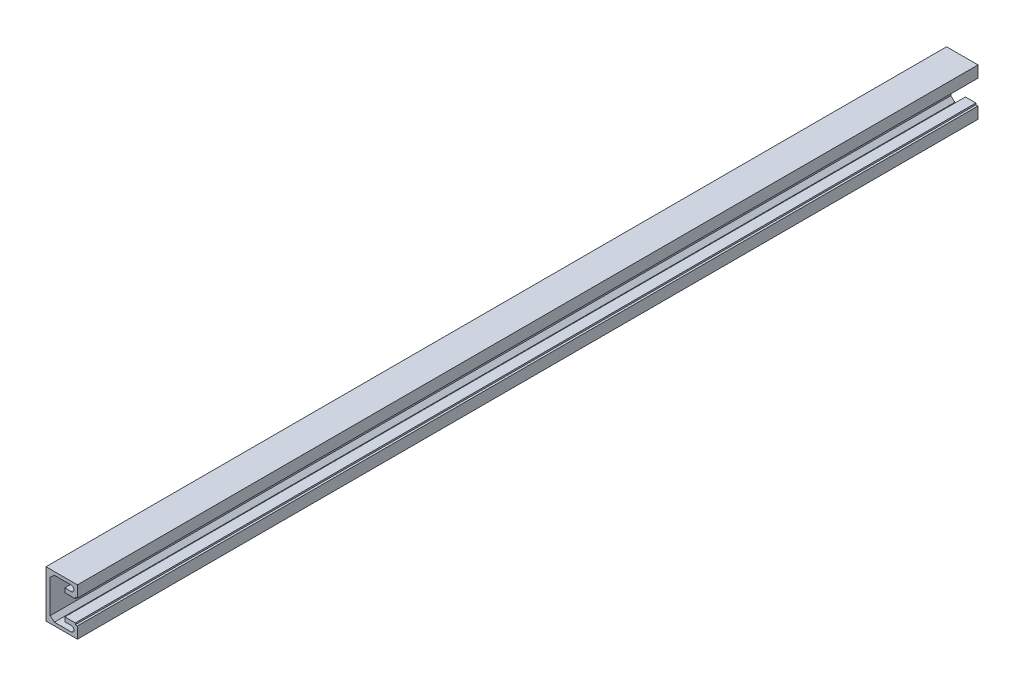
ISO-10303-21;
HEADER;
FILE_DESCRIPTION(('STEP AP214'),'2;1');
FILE_NAME('part.step','',(''),(''),'','','');
FILE_SCHEMA(('AUTOMOTIVE_DESIGN { 1 0 10303 214 1 1 1 1 }'));
ENDSEC;
DATA;
#1=APPLICATION_CONTEXT('core data for automotive mechanical design processes');
#2=APPLICATION_PROTOCOL_DEFINITION('international standard','automotive_design',2000,#1);
#3=PRODUCT_CONTEXT('',#1,'mechanical');
#4=PRODUCT('Part','Part','',(#3));
#5=PRODUCT_RELATED_PRODUCT_CATEGORY('part','',(#4));
#6=PRODUCT_DEFINITION_FORMATION('','',#4);
#7=PRODUCT_DEFINITION_CONTEXT('part definition',#1,'design');
#8=PRODUCT_DEFINITION('design','',#6,#7);
#9=PRODUCT_DEFINITION_SHAPE('','',#8);
#10=(LENGTH_UNIT() NAMED_UNIT(*) SI_UNIT(.MILLI.,.METRE.));
#11=(NAMED_UNIT(*) PLANE_ANGLE_UNIT() SI_UNIT($,.RADIAN.));
#12=(NAMED_UNIT(*) SI_UNIT($,.STERADIAN.) SOLID_ANGLE_UNIT());
#13=UNCERTAINTY_MEASURE_WITH_UNIT(LENGTH_MEASURE(1.E-05),#10,'distance_accuracy_value','');
#14=(GEOMETRIC_REPRESENTATION_CONTEXT(3) GLOBAL_UNCERTAINTY_ASSIGNED_CONTEXT((#13)) GLOBAL_UNIT_ASSIGNED_CONTEXT((#10,
#11,#12)) REPRESENTATION_CONTEXT('',''));
#15=CARTESIAN_POINT('',(0.,0.,0.));
#16=DIRECTION('',(0.,0.,1.));
#17=DIRECTION('',(1.,0.,0.));
#18=AXIS2_PLACEMENT_3D('',#15,#16,#17);
#19=CARTESIAN_POINT('',(0.,-11.25,430.));
#20=DIRECTION('',(0.,1.,0.));
#21=DIRECTION('',(0.,0.,1.));
#22=AXIS2_PLACEMENT_3D('',#19,#20,#21);
#23=PLANE('',#22);
#24=DIRECTION('',(1.,0.,0.));
#25=VECTOR('',#24,1.);
#26=CARTESIAN_POINT('',(0.,-11.25,0.));
#27=LINE('',#26,#25);
#28=CARTESIAN_POINT('',(0.,-11.25,0.));
#29=VERTEX_POINT('',#28);
#30=CARTESIAN_POINT('',(15.,-11.25,0.));
#31=VERTEX_POINT('',#30);
#32=EDGE_CURVE('E216',#29,#31,#27,.T.);
#33=ORIENTED_EDGE('',*,*,#32,.T.);
#34=DIRECTION('',(0.,0.,-1.));
#35=VECTOR('',#34,1.);
#36=CARTESIAN_POINT('',(15.,-11.25,430.));
#37=LINE('',#36,#35);
#38=CARTESIAN_POINT('',(15.,-11.25,430.));
#39=VERTEX_POINT('',#38);
#40=EDGE_CURVE('E11',#39,#31,#37,.T.);
#41=ORIENTED_EDGE('',*,*,#40,.F.);
#42=DIRECTION('',(1.,0.,0.));
#43=VECTOR('',#42,1.);
#44=CARTESIAN_POINT('',(0.,-11.25,430.));
#45=LINE('',#44,#43);
#46=CARTESIAN_POINT('',(0.,-11.25,430.));
#47=VERTEX_POINT('',#46);
#48=EDGE_CURVE('E258',#47,#39,#45,.T.);
#49=ORIENTED_EDGE('',*,*,#48,.F.);
#50=DIRECTION('',(0.,0.,-1.));
#51=VECTOR('',#50,1.);
#52=CARTESIAN_POINT('',(0.,-11.25,430.));
#53=LINE('',#52,#51);
#54=EDGE_CURVE('E212',#47,#29,#53,.T.);
#55=ORIENTED_EDGE('',*,*,#54,.T.);
#56=EDGE_LOOP('',(#33,#41,#49,#55));
#57=FACE_BOUND('',#56,.T.);
#58=ADVANCED_FACE('F36',(#57),#23,.F.);
#59=CARTESIAN_POINT('',(15.,-11.25,430.));
#60=DIRECTION('',(-1.,0.,0.));
#61=DIRECTION('',(0.,0.,1.));
#62=AXIS2_PLACEMENT_3D('',#59,#60,#61);
#63=PLANE('',#62);
#64=DIRECTION('',(0.,1.,0.));
#65=VECTOR('',#64,1.);
#66=CARTESIAN_POINT('',(15.,-11.25,0.));
#67=LINE('',#66,#65);
#68=CARTESIAN_POINT('',(15.,-5.75,0.));
#69=VERTEX_POINT('',#68);
#70=EDGE_CURVE('E219',#31,#69,#67,.T.);
#71=ORIENTED_EDGE('',*,*,#70,.T.);
#72=DIRECTION('',(0.,0.,-1.));
#73=VECTOR('',#72,1.);
#74=CARTESIAN_POINT('',(15.,-5.75,430.));
#75=LINE('',#74,#73);
#76=CARTESIAN_POINT('',(15.,-5.75,430.));
#77=VERTEX_POINT('',#76);
#78=EDGE_CURVE('E44',#77,#69,#75,.T.);
#79=ORIENTED_EDGE('',*,*,#78,.F.);
#80=DIRECTION('',(0.,1.,0.));
#81=VECTOR('',#80,1.);
#82=CARTESIAN_POINT('',(15.,-11.25,430.));
#83=LINE('',#82,#81);
#84=EDGE_CURVE('E137',#39,#77,#83,.T.);
#85=ORIENTED_EDGE('',*,*,#84,.F.);
#86=ORIENTED_EDGE('',*,*,#40,.T.);
#87=EDGE_LOOP('',(#71,#79,#85,#86));
#88=FACE_BOUND('',#87,.T.);
#89=ADVANCED_FACE('F386',(#88),#63,.F.);
#90=CARTESIAN_POINT('',(15.,-5.75,430.));
#91=DIRECTION('',(0.,-1.,0.));
#92=DIRECTION('',(0.,0.,-1.));
#93=AXIS2_PLACEMENT_3D('',#90,#91,#92);
#94=PLANE('',#93);
#95=DIRECTION('',(-1.,0.,0.));
#96=VECTOR('',#95,1.);
#97=CARTESIAN_POINT('',(15.,-5.75,0.));
#98=LINE('',#97,#96);
#99=CARTESIAN_POINT('',(14.,-5.75,0.));
#100=VERTEX_POINT('',#99);
#101=EDGE_CURVE('E221',#69,#100,#98,.T.);
#102=ORIENTED_EDGE('',*,*,#101,.T.);
#103=DIRECTION('',(0.,0.,-1.));
#104=VECTOR('',#103,1.);
#105=CARTESIAN_POINT('',(14.,-5.75,430.));
#106=LINE('',#105,#104);
#107=CARTESIAN_POINT('',(14.,-5.75,430.));
#108=VERTEX_POINT('',#107);
#109=EDGE_CURVE('E307',#108,#100,#106,.T.);
#110=ORIENTED_EDGE('',*,*,#109,.F.);
#111=DIRECTION('',(-1.,0.,0.));
#112=VECTOR('',#111,1.);
#113=CARTESIAN_POINT('',(15.,-5.75,430.));
#114=LINE('',#113,#112);
#115=EDGE_CURVE('E315',#77,#108,#114,.T.);
#116=ORIENTED_EDGE('',*,*,#115,.F.);
#117=ORIENTED_EDGE('',*,*,#78,.T.);
#118=EDGE_LOOP('',(#102,#110,#116,#117));
#119=FACE_BOUND('',#118,.T.);
#120=ADVANCED_FACE('F313',(#119),#94,.F.);
#121=CARTESIAN_POINT('',(14.,-5.75,430.));
#122=DIRECTION('',(-1.,0.,0.));
#123=DIRECTION('',(0.,0.,1.));
#124=AXIS2_PLACEMENT_3D('',#121,#122,#123);
#125=PLANE('',#124);
#126=DIRECTION('',(0.,1.,0.));
#127=VECTOR('',#126,1.);
#128=CARTESIAN_POINT('',(14.,-5.75,0.));
#129=LINE('',#128,#127);
#130=CARTESIAN_POINT('',(14.,-5.,0.));
#131=VERTEX_POINT('',#130);
#132=EDGE_CURVE('E223',#100,#131,#129,.T.);
#133=ORIENTED_EDGE('',*,*,#132,.T.);
#134=DIRECTION('',(0.,0.,-1.));
#135=VECTOR('',#134,1.);
#136=CARTESIAN_POINT('',(14.,-5.,430.));
#137=LINE('',#136,#135);
#138=CARTESIAN_POINT('',(14.,-5.,430.));
#139=VERTEX_POINT('',#138);
#140=EDGE_CURVE('E304',#139,#131,#137,.T.);
#141=ORIENTED_EDGE('',*,*,#140,.F.);
#142=DIRECTION('',(0.,1.,0.));
#143=VECTOR('',#142,1.);
#144=CARTESIAN_POINT('',(14.,-5.75,430.));
#145=LINE('',#144,#143);
#146=EDGE_CURVE('E333',#108,#139,#145,.T.);
#147=ORIENTED_EDGE('',*,*,#146,.F.);
#148=ORIENTED_EDGE('',*,*,#109,.T.);
#149=EDGE_LOOP('',(#133,#141,#147,#148));
#150=FACE_BOUND('',#149,.T.);
#151=ADVANCED_FACE('F324',(#150),#125,.F.);
#152=CARTESIAN_POINT('',(14.,-5.,430.));
#153=DIRECTION('',(0.,-1.,0.));
#154=DIRECTION('',(1.,0.,0.));
#155=AXIS2_PLACEMENT_3D('',#152,#153,#154);
#156=PLANE('',#155);
#157=DIRECTION('',(-1.,0.,0.));
#158=VECTOR('',#157,1.);
#159=CARTESIAN_POINT('',(14.,-5.,0.));
#160=LINE('',#159,#158);
#161=CARTESIAN_POINT('',(9.,-5.,0.));
#162=VERTEX_POINT('',#161);
#163=EDGE_CURVE('E225',#131,#162,#160,.T.);
#164=ORIENTED_EDGE('',*,*,#163,.T.);
#165=DIRECTION('',(0.,0.,-1.));
#166=VECTOR('',#165,1.);
#167=CARTESIAN_POINT('',(9.,-5.,430.));
#168=LINE('',#167,#166);
#169=CARTESIAN_POINT('',(9.,-5.,430.));
#170=VERTEX_POINT('',#169);
#171=EDGE_CURVE('E301',#170,#162,#168,.T.);
#172=ORIENTED_EDGE('',*,*,#171,.F.);
#173=DIRECTION('',(-1.,0.,0.));
#174=VECTOR('',#173,1.);
#175=CARTESIAN_POINT('',(14.,-5.,430.));
#176=LINE('',#175,#174);
#177=EDGE_CURVE('E330',#139,#170,#176,.T.);
#178=ORIENTED_EDGE('',*,*,#177,.F.);
#179=ORIENTED_EDGE('',*,*,#140,.T.);
#180=EDGE_LOOP('',(#164,#172,#178,#179));
#181=FACE_BOUND('',#180,.T.);
#182=ADVANCED_FACE('F328',(#181),#156,.F.);
#183=CARTESIAN_POINT('',(9.,-5.,430.));
#184=DIRECTION('',(1.,0.,0.));
#185=DIRECTION('',(0.,0.,-1.));
#186=AXIS2_PLACEMENT_3D('',#183,#184,#185);
#187=PLANE('',#186);
#188=DIRECTION('',(0.,-1.,0.));
#189=VECTOR('',#188,1.);
#190=CARTESIAN_POINT('',(9.,-5.,0.));
#191=LINE('',#190,#189);
#192=CARTESIAN_POINT('',(9.,-7.00471698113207,0.));
#193=VERTEX_POINT('',#192);
#194=EDGE_CURVE('E227',#162,#193,#191,.T.);
#195=ORIENTED_EDGE('',*,*,#194,.T.);
#196=DIRECTION('',(0.,0.,-1.));
#197=VECTOR('',#196,1.);
#198=CARTESIAN_POINT('',(9.,-7.00471698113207,430.));
#199=LINE('',#198,#197);
#200=CARTESIAN_POINT('',(9.,-7.00471698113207,430.));
#201=VERTEX_POINT('',#200);
#202=EDGE_CURVE('E298',#201,#193,#199,.T.);
#203=ORIENTED_EDGE('',*,*,#202,.F.);
#204=DIRECTION('',(0.,-1.,0.));
#205=VECTOR('',#204,1.);
#206=CARTESIAN_POINT('',(9.,-5.,430.));
#207=LINE('',#206,#205);
#208=EDGE_CURVE('E332',#170,#201,#207,.T.);
#209=ORIENTED_EDGE('',*,*,#208,.F.);
#210=ORIENTED_EDGE('',*,*,#171,.T.);
#211=EDGE_LOOP('',(#195,#203,#209,#210));
#212=FACE_BOUND('',#211,.T.);
#213=ADVANCED_FACE('F399',(#212),#187,.F.);
#214=CARTESIAN_POINT('',(9.,-7.00471698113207,430.));
#215=DIRECTION('',(0.,1.,0.));
#216=DIRECTION('',(-1.,0.,0.));
#217=AXIS2_PLACEMENT_3D('',#214,#215,#216);
#218=PLANE('',#217);
#219=DIRECTION('',(1.,0.,0.));
#220=VECTOR('',#219,1.);
#221=CARTESIAN_POINT('',(9.,-7.00471698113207,0.));
#222=LINE('',#221,#220);
#223=CARTESIAN_POINT('',(12.,-7.00471698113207,0.));
#224=VERTEX_POINT('',#223);
#225=EDGE_CURVE('E229',#193,#224,#222,.T.);
#226=ORIENTED_EDGE('',*,*,#225,.T.);
#227=DIRECTION('',(0.,0.,-1.));
#228=VECTOR('',#227,1.);
#229=CARTESIAN_POINT('',(12.,-7.00471698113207,430.));
#230=LINE('',#229,#228);
#231=CARTESIAN_POINT('',(12.,-7.00471698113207,430.));
#232=VERTEX_POINT('',#231);
#233=EDGE_CURVE('E295',#232,#224,#230,.T.);
#234=ORIENTED_EDGE('',*,*,#233,.F.);
#235=DIRECTION('',(1.,0.,0.));
#236=VECTOR('',#235,1.);
#237=CARTESIAN_POINT('',(9.,-7.00471698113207,430.));
#238=LINE('',#237,#236);
#239=EDGE_CURVE('E335',#201,#232,#238,.T.);
#240=ORIENTED_EDGE('',*,*,#239,.F.);
#241=ORIENTED_EDGE('',*,*,#202,.T.);
#242=EDGE_LOOP('',(#226,#234,#240,#241));
#243=FACE_BOUND('',#242,.T.);
#244=ADVANCED_FACE('F402',(#243),#218,.F.);
#245=CARTESIAN_POINT('',(12.,-8.34905660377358,430.));
#246=DIRECTION('',(0.,0.,-1.));
#247=DIRECTION('',(-1.,0.,0.));
#248=AXIS2_PLACEMENT_3D('',#245,#246,#247);
#249=CYLINDRICAL_SURFACE('',#248,1.34433962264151);
#250=CARTESIAN_POINT('',(12.,-8.34905660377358,0.));
#251=DIRECTION('',(0.,0.,-1.));
#252=DIRECTION('',(-1.,0.,0.));
#253=AXIS2_PLACEMENT_3D('',#250,#251,#252);
#254=CIRCLE('',#253,1.34433962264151);
#255=CARTESIAN_POINT('',(12.,-9.69339622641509,0.));
#256=VERTEX_POINT('',#255);
#257=EDGE_CURVE('E231',#224,#256,#254,.T.);
#258=ORIENTED_EDGE('',*,*,#257,.T.);
#259=DIRECTION('',(0.,0.,-1.));
#260=VECTOR('',#259,1.);
#261=CARTESIAN_POINT('',(12.,-9.69339622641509,430.));
#262=LINE('',#261,#260);
#263=CARTESIAN_POINT('',(12.,-9.69339622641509,430.));
#264=VERTEX_POINT('',#263);
#265=EDGE_CURVE('E292',#264,#256,#262,.T.);
#266=ORIENTED_EDGE('',*,*,#265,.F.);
#267=CARTESIAN_POINT('',(12.,-8.34905660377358,430.));
#268=DIRECTION('',(0.,0.,-1.));
#269=DIRECTION('',(-1.,0.,0.));
#270=AXIS2_PLACEMENT_3D('',#267,#268,#269);
#271=CIRCLE('',#270,1.34433962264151);
#272=EDGE_CURVE('E341',#232,#264,#271,.T.);
#273=ORIENTED_EDGE('',*,*,#272,.F.);
#274=ORIENTED_EDGE('',*,*,#233,.T.);
#275=EDGE_LOOP('',(#258,#266,#273,#274));
#276=FACE_BOUND('',#275,.T.);
#277=ADVANCED_FACE('F406',(#276),#249,.F.);
#278=CARTESIAN_POINT('',(12.,-9.69339622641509,430.));
#279=DIRECTION('',(0.,-1.,0.));
#280=DIRECTION('',(1.,0.,0.));
#281=AXIS2_PLACEMENT_3D('',#278,#279,#280);
#282=PLANE('',#281);
#283=DIRECTION('',(-1.,0.,0.));
#284=VECTOR('',#283,1.);
#285=CARTESIAN_POINT('',(12.,-9.69339622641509,0.));
#286=LINE('',#285,#284);
#287=CARTESIAN_POINT('',(4.,-9.69339622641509,0.));
#288=VERTEX_POINT('',#287);
#289=EDGE_CURVE('E233',#256,#288,#286,.T.);
#290=ORIENTED_EDGE('',*,*,#289,.T.);
#291=DIRECTION('',(0.,0.,-1.));
#292=VECTOR('',#291,1.);
#293=CARTESIAN_POINT('',(4.,-9.69339622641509,430.));
#294=LINE('',#293,#292);
#295=CARTESIAN_POINT('',(4.,-9.69339622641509,430.));
#296=VERTEX_POINT('',#295);
#297=EDGE_CURVE('E289',#296,#288,#294,.T.);
#298=ORIENTED_EDGE('',*,*,#297,.F.);
#299=DIRECTION('',(-1.,0.,0.));
#300=VECTOR('',#299,1.);
#301=CARTESIAN_POINT('',(12.,-9.69339622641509,430.));
#302=LINE('',#301,#300);
#303=EDGE_CURVE('E343',#264,#296,#302,.T.);
#304=ORIENTED_EDGE('',*,*,#303,.F.);
#305=ORIENTED_EDGE('',*,*,#265,.T.);
#306=EDGE_LOOP('',(#290,#298,#304,#305));
#307=FACE_BOUND('',#306,.T.);
#308=ADVANCED_FACE('F410',(#307),#282,.F.);
#309=CARTESIAN_POINT('',(2.,-8.,430.));
#310=DIRECTION('',(-0.646184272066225,-0.763181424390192,0.));
#311=DIRECTION('',(0.763181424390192,-0.646184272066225,0.));
#312=AXIS2_PLACEMENT_3D('',#309,#310,#311);
#313=PLANE('',#312);
#314=DIRECTION('',(-0.763181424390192,0.646184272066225,0.));
#315=VECTOR('',#314,1.);
#316=CARTESIAN_POINT('',(2.,-8.,0.));
#317=LINE('',#316,#315);
#318=CARTESIAN_POINT('',(2.,-8.,0.));
#319=VERTEX_POINT('',#318);
#320=EDGE_CURVE('E235',#288,#319,#317,.T.);
#321=ORIENTED_EDGE('',*,*,#320,.T.);
#322=DIRECTION('',(0.,0.,-1.));
#323=VECTOR('',#322,1.);
#324=CARTESIAN_POINT('',(2.,-8.,430.));
#325=LINE('',#324,#323);
#326=CARTESIAN_POINT('',(2.,-8.,430.));
#327=VERTEX_POINT('',#326);
#328=EDGE_CURVE('E286',#327,#319,#325,.T.);
#329=ORIENTED_EDGE('',*,*,#328,.F.);
#330=DIRECTION('',(-0.763181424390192,0.646184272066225,0.));
#331=VECTOR('',#330,1.);
#332=CARTESIAN_POINT('',(2.,-8.,430.));
#333=LINE('',#332,#331);
#334=EDGE_CURVE('E345',#296,#327,#333,.T.);
#335=ORIENTED_EDGE('',*,*,#334,.F.);
#336=ORIENTED_EDGE('',*,*,#297,.T.);
#337=EDGE_LOOP('',(#321,#329,#335,#336));
#338=FACE_BOUND('',#337,.T.);
#339=ADVANCED_FACE('F414',(#338),#313,.F.);
#340=CARTESIAN_POINT('',(2.,-8.,430.));
#341=DIRECTION('',(-1.,0.,0.));
#342=DIRECTION('',(0.,0.,1.));
#343=AXIS2_PLACEMENT_3D('',#340,#341,#342);
#344=PLANE('',#343);
#345=DIRECTION('',(0.,1.,0.));
#346=VECTOR('',#345,1.);
#347=CARTESIAN_POINT('',(2.,-8.,0.));
#348=LINE('',#347,#346);
#349=CARTESIAN_POINT('',(2.,8.,0.));
#350=VERTEX_POINT('',#349);
#351=EDGE_CURVE('E237',#319,#350,#348,.T.);
#352=ORIENTED_EDGE('',*,*,#351,.T.);
#353=DIRECTION('',(0.,0.,-1.));
#354=VECTOR('',#353,1.);
#355=CARTESIAN_POINT('',(2.,8.,430.));
#356=LINE('',#355,#354);
#357=CARTESIAN_POINT('',(2.,8.,430.));
#358=VERTEX_POINT('',#357);
#359=EDGE_CURVE('E283',#358,#350,#356,.T.);
#360=ORIENTED_EDGE('',*,*,#359,.F.);
#361=DIRECTION('',(0.,1.,0.));
#362=VECTOR('',#361,1.);
#363=CARTESIAN_POINT('',(2.,-8.,430.));
#364=LINE('',#363,#362);
#365=EDGE_CURVE('E347',#327,#358,#364,.T.);
#366=ORIENTED_EDGE('',*,*,#365,.F.);
#367=ORIENTED_EDGE('',*,*,#328,.T.);
#368=EDGE_LOOP('',(#352,#360,#366,#367));
#369=FACE_BOUND('',#368,.T.);
#370=ADVANCED_FACE('F418',(#369),#344,.F.);
#371=CARTESIAN_POINT('',(2.,8.,430.));
#372=DIRECTION('',(-0.646184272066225,0.763181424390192,0.));
#373=DIRECTION('',(-0.763181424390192,-0.646184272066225,0.));
#374=AXIS2_PLACEMENT_3D('',#371,#372,#373);
#375=PLANE('',#374);
#376=DIRECTION('',(0.763181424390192,0.646184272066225,0.));
#377=VECTOR('',#376,1.);
#378=CARTESIAN_POINT('',(2.,8.,0.));
#379=LINE('',#378,#377);
#380=CARTESIAN_POINT('',(4.,9.69339622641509,0.));
#381=VERTEX_POINT('',#380);
#382=EDGE_CURVE('E239',#350,#381,#379,.T.);
#383=ORIENTED_EDGE('',*,*,#382,.T.);
#384=DIRECTION('',(0.,0.,-1.));
#385=VECTOR('',#384,1.);
#386=CARTESIAN_POINT('',(4.,9.69339622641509,430.));
#387=LINE('',#386,#385);
#388=CARTESIAN_POINT('',(4.,9.69339622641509,430.));
#389=VERTEX_POINT('',#388);
#390=EDGE_CURVE('E280',#389,#381,#387,.T.);
#391=ORIENTED_EDGE('',*,*,#390,.F.);
#392=DIRECTION('',(0.763181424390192,0.646184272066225,0.));
#393=VECTOR('',#392,1.);
#394=CARTESIAN_POINT('',(2.,8.,430.));
#395=LINE('',#394,#393);
#396=EDGE_CURVE('E349',#358,#389,#395,.T.);
#397=ORIENTED_EDGE('',*,*,#396,.F.);
#398=ORIENTED_EDGE('',*,*,#359,.T.);
#399=EDGE_LOOP('',(#383,#391,#397,#398));
#400=FACE_BOUND('',#399,.T.);
#401=ADVANCED_FACE('F422',(#400),#375,.F.);
#402=CARTESIAN_POINT('',(12.,9.69339622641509,430.));
#403=DIRECTION('',(0.,1.,0.));
#404=DIRECTION('',(-1.,0.,0.));
#405=AXIS2_PLACEMENT_3D('',#402,#403,#404);
#406=PLANE('',#405);
#407=DIRECTION('',(1.,0.,0.));
#408=VECTOR('',#407,1.);
#409=CARTESIAN_POINT('',(12.,9.69339622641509,0.));
#410=LINE('',#409,#408);
#411=CARTESIAN_POINT('',(12.,9.69339622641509,0.));
#412=VERTEX_POINT('',#411);
#413=EDGE_CURVE('E241',#381,#412,#410,.T.);
#414=ORIENTED_EDGE('',*,*,#413,.T.);
#415=DIRECTION('',(0.,0.,-1.));
#416=VECTOR('',#415,1.);
#417=CARTESIAN_POINT('',(12.,9.69339622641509,430.));
#418=LINE('',#417,#416);
#419=CARTESIAN_POINT('',(12.,9.69339622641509,430.));
#420=VERTEX_POINT('',#419);
#421=EDGE_CURVE('E277',#420,#412,#418,.T.);
#422=ORIENTED_EDGE('',*,*,#421,.F.);
#423=DIRECTION('',(1.,0.,0.));
#424=VECTOR('',#423,1.);
#425=CARTESIAN_POINT('',(12.,9.69339622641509,430.));
#426=LINE('',#425,#424);
#427=EDGE_CURVE('E351',#389,#420,#426,.T.);
#428=ORIENTED_EDGE('',*,*,#427,.F.);
#429=ORIENTED_EDGE('',*,*,#390,.T.);
#430=EDGE_LOOP('',(#414,#422,#428,#429));
#431=FACE_BOUND('',#430,.T.);
#432=ADVANCED_FACE('F426',(#431),#406,.F.);
#433=CARTESIAN_POINT('',(12.,8.34905660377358,430.));
#434=DIRECTION('',(0.,0.,-1.));
#435=DIRECTION('',(-1.,0.,0.));
#436=AXIS2_PLACEMENT_3D('',#433,#434,#435);
#437=CYLINDRICAL_SURFACE('',#436,1.34433962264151);
#438=CARTESIAN_POINT('',(12.,8.34905660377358,0.));
#439=DIRECTION('',(0.,0.,-1.));
#440=DIRECTION('',(1.,0.,0.));
#441=AXIS2_PLACEMENT_3D('',#438,#439,#440);
#442=CIRCLE('',#441,1.34433962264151);
#443=CARTESIAN_POINT('',(12.,7.00471698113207,0.));
#444=VERTEX_POINT('',#443);
#445=EDGE_CURVE('E243',#412,#444,#442,.T.);
#446=ORIENTED_EDGE('',*,*,#445,.T.);
#447=DIRECTION('',(0.,0.,-1.));
#448=VECTOR('',#447,1.);
#449=CARTESIAN_POINT('',(12.,7.00471698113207,430.));
#450=LINE('',#449,#448);
#451=CARTESIAN_POINT('',(12.,7.00471698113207,430.));
#452=VERTEX_POINT('',#451);
#453=EDGE_CURVE('E274',#452,#444,#450,.T.);
#454=ORIENTED_EDGE('',*,*,#453,.F.);
#455=CARTESIAN_POINT('',(12.,8.34905660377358,430.));
#456=DIRECTION('',(0.,0.,-1.));
#457=DIRECTION('',(1.,0.,0.));
#458=AXIS2_PLACEMENT_3D('',#455,#456,#457);
#459=CIRCLE('',#458,1.34433962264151);
#460=EDGE_CURVE('E353',#420,#452,#459,.T.);
#461=ORIENTED_EDGE('',*,*,#460,.F.);
#462=ORIENTED_EDGE('',*,*,#421,.T.);
#463=EDGE_LOOP('',(#446,#454,#461,#462));
#464=FACE_BOUND('',#463,.T.);
#465=ADVANCED_FACE('F430',(#464),#437,.F.);
#466=CARTESIAN_POINT('',(9.,7.00471698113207,430.));
#467=DIRECTION('',(0.,-1.,0.));
#468=DIRECTION('',(1.,0.,0.));
#469=AXIS2_PLACEMENT_3D('',#466,#467,#468);
#470=PLANE('',#469);
#471=DIRECTION('',(-1.,0.,0.));
#472=VECTOR('',#471,1.);
#473=CARTESIAN_POINT('',(9.,7.00471698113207,0.));
#474=LINE('',#473,#472);
#475=CARTESIAN_POINT('',(9.,7.00471698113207,0.));
#476=VERTEX_POINT('',#475);
#477=EDGE_CURVE('E245',#444,#476,#474,.T.);
#478=ORIENTED_EDGE('',*,*,#477,.T.);
#479=DIRECTION('',(0.,0.,-1.));
#480=VECTOR('',#479,1.);
#481=CARTESIAN_POINT('',(9.,7.00471698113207,430.));
#482=LINE('',#481,#480);
#483=CARTESIAN_POINT('',(9.,7.00471698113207,430.));
#484=VERTEX_POINT('',#483);
#485=EDGE_CURVE('E271',#484,#476,#482,.T.);
#486=ORIENTED_EDGE('',*,*,#485,.F.);
#487=DIRECTION('',(-1.,0.,0.));
#488=VECTOR('',#487,1.);
#489=CARTESIAN_POINT('',(9.,7.00471698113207,430.));
#490=LINE('',#489,#488);
#491=EDGE_CURVE('E355',#452,#484,#490,.T.);
#492=ORIENTED_EDGE('',*,*,#491,.F.);
#493=ORIENTED_EDGE('',*,*,#453,.T.);
#494=EDGE_LOOP('',(#478,#486,#492,#493));
#495=FACE_BOUND('',#494,.T.);
#496=ADVANCED_FACE('F434',(#495),#470,.F.);
#497=CARTESIAN_POINT('',(9.,5.,430.));
#498=DIRECTION('',(1.,0.,0.));
#499=DIRECTION('',(0.,0.,-1.));
#500=AXIS2_PLACEMENT_3D('',#497,#498,#499);
#501=PLANE('',#500);
#502=DIRECTION('',(0.,-1.,0.));
#503=VECTOR('',#502,1.);
#504=CARTESIAN_POINT('',(9.,5.,0.));
#505=LINE('',#504,#503);
#506=CARTESIAN_POINT('',(9.,5.,0.));
#507=VERTEX_POINT('',#506);
#508=EDGE_CURVE('E247',#476,#507,#505,.T.);
#509=ORIENTED_EDGE('',*,*,#508,.T.);
#510=DIRECTION('',(0.,0.,-1.));
#511=VECTOR('',#510,1.);
#512=CARTESIAN_POINT('',(9.,5.,430.));
#513=LINE('',#512,#511);
#514=CARTESIAN_POINT('',(9.,5.,430.));
#515=VERTEX_POINT('',#514);
#516=EDGE_CURVE('E268',#515,#507,#513,.T.);
#517=ORIENTED_EDGE('',*,*,#516,.F.);
#518=DIRECTION('',(0.,-1.,0.));
#519=VECTOR('',#518,1.);
#520=CARTESIAN_POINT('',(9.,5.,430.));
#521=LINE('',#520,#519);
#522=EDGE_CURVE('E357',#484,#515,#521,.T.);
#523=ORIENTED_EDGE('',*,*,#522,.F.);
#524=ORIENTED_EDGE('',*,*,#485,.T.);
#525=EDGE_LOOP('',(#509,#517,#523,#524));
#526=FACE_BOUND('',#525,.T.);
#527=ADVANCED_FACE('F438',(#526),#501,.F.);
#528=CARTESIAN_POINT('',(14.,5.,430.));
#529=DIRECTION('',(0.,1.,0.));
#530=DIRECTION('',(-1.,0.,0.));
#531=AXIS2_PLACEMENT_3D('',#528,#529,#530);
#532=PLANE('',#531);
#533=DIRECTION('',(1.,0.,0.));
#534=VECTOR('',#533,1.);
#535=CARTESIAN_POINT('',(14.,5.,0.));
#536=LINE('',#535,#534);
#537=CARTESIAN_POINT('',(14.,5.,0.));
#538=VERTEX_POINT('',#537);
#539=EDGE_CURVE('E249',#507,#538,#536,.T.);
#540=ORIENTED_EDGE('',*,*,#539,.T.);
#541=DIRECTION('',(0.,0.,-1.));
#542=VECTOR('',#541,1.);
#543=CARTESIAN_POINT('',(14.,5.,430.));
#544=LINE('',#543,#542);
#545=CARTESIAN_POINT('',(14.,5.,430.));
#546=VERTEX_POINT('',#545);
#547=EDGE_CURVE('E265',#546,#538,#544,.T.);
#548=ORIENTED_EDGE('',*,*,#547,.F.);
#549=DIRECTION('',(1.,0.,0.));
#550=VECTOR('',#549,1.);
#551=CARTESIAN_POINT('',(14.,5.,430.));
#552=LINE('',#551,#550);
#553=EDGE_CURVE('E359',#515,#546,#552,.T.);
#554=ORIENTED_EDGE('',*,*,#553,.F.);
#555=ORIENTED_EDGE('',*,*,#516,.T.);
#556=EDGE_LOOP('',(#540,#548,#554,#555));
#557=FACE_BOUND('',#556,.T.);
#558=ADVANCED_FACE('F442',(#557),#532,.F.);
#559=CARTESIAN_POINT('',(14.,5.75,430.));
#560=DIRECTION('',(-1.,0.,0.));
#561=DIRECTION('',(0.,0.,1.));
#562=AXIS2_PLACEMENT_3D('',#559,#560,#561);
#563=PLANE('',#562);
#564=DIRECTION('',(0.,1.,0.));
#565=VECTOR('',#564,1.);
#566=CARTESIAN_POINT('',(14.,5.75,0.));
#567=LINE('',#566,#565);
#568=CARTESIAN_POINT('',(14.,5.75,0.));
#569=VERTEX_POINT('',#568);
#570=EDGE_CURVE('E251',#538,#569,#567,.T.);
#571=ORIENTED_EDGE('',*,*,#570,.T.);
#572=DIRECTION('',(0.,0.,-1.));
#573=VECTOR('',#572,1.);
#574=CARTESIAN_POINT('',(14.,5.75,430.));
#575=LINE('',#574,#573);
#576=CARTESIAN_POINT('',(14.,5.75,430.));
#577=VERTEX_POINT('',#576);
#578=EDGE_CURVE('E262',#577,#569,#575,.T.);
#579=ORIENTED_EDGE('',*,*,#578,.F.);
#580=DIRECTION('',(0.,1.,0.));
#581=VECTOR('',#580,1.);
#582=CARTESIAN_POINT('',(14.,5.75,430.));
#583=LINE('',#582,#581);
#584=EDGE_CURVE('E361',#546,#577,#583,.T.);
#585=ORIENTED_EDGE('',*,*,#584,.F.);
#586=ORIENTED_EDGE('',*,*,#547,.T.);
#587=EDGE_LOOP('',(#571,#579,#585,#586));
#588=FACE_BOUND('',#587,.T.);
#589=ADVANCED_FACE('F367',(#588),#563,.F.);
#590=CARTESIAN_POINT('',(15.,5.75,430.));
#591=DIRECTION('',(0.,1.,0.));
#592=DIRECTION('',(0.,0.,1.));
#593=AXIS2_PLACEMENT_3D('',#590,#591,#592);
#594=PLANE('',#593);
#595=DIRECTION('',(1.,0.,0.));
#596=VECTOR('',#595,1.);
#597=CARTESIAN_POINT('',(15.,5.75,0.));
#598=LINE('',#597,#596);
#599=CARTESIAN_POINT('',(15.,5.75,0.));
#600=VERTEX_POINT('',#599);
#601=EDGE_CURVE('E253',#569,#600,#598,.T.);
#602=ORIENTED_EDGE('',*,*,#601,.T.);
#603=DIRECTION('',(0.,0.,-1.));
#604=VECTOR('',#603,1.);
#605=CARTESIAN_POINT('',(15.,5.75,430.));
#606=LINE('',#605,#604);
#607=CARTESIAN_POINT('',(15.,5.75,430.));
#608=VERTEX_POINT('',#607);
#609=EDGE_CURVE('E207',#608,#600,#606,.T.);
#610=ORIENTED_EDGE('',*,*,#609,.F.);
#611=DIRECTION('',(1.,0.,0.));
#612=VECTOR('',#611,1.);
#613=CARTESIAN_POINT('',(15.,5.75,430.));
#614=LINE('',#613,#612);
#615=EDGE_CURVE('E198',#577,#608,#614,.T.);
#616=ORIENTED_EDGE('',*,*,#615,.F.);
#617=ORIENTED_EDGE('',*,*,#578,.T.);
#618=EDGE_LOOP('',(#602,#610,#616,#617));
#619=FACE_BOUND('',#618,.T.);
#620=ADVANCED_FACE('F371',(#619),#594,.F.);
#621=CARTESIAN_POINT('',(15.,11.25,430.));
#622=DIRECTION('',(-1.,0.,0.));
#623=DIRECTION('',(0.,0.,1.));
#624=AXIS2_PLACEMENT_3D('',#621,#622,#623);
#625=PLANE('',#624);
#626=DIRECTION('',(0.,1.,0.));
#627=VECTOR('',#626,1.);
#628=CARTESIAN_POINT('',(15.,11.25,0.));
#629=LINE('',#628,#627);
#630=CARTESIAN_POINT('',(15.,11.25,0.));
#631=VERTEX_POINT('',#630);
#632=EDGE_CURVE('E206',#600,#631,#629,.T.);
#633=ORIENTED_EDGE('',*,*,#632,.T.);
#634=DIRECTION('',(0.,0.,-1.));
#635=VECTOR('',#634,1.);
#636=CARTESIAN_POINT('',(15.,11.25,430.));
#637=LINE('',#636,#635);
#638=CARTESIAN_POINT('',(15.,11.25,430.));
#639=VERTEX_POINT('',#638);
#640=EDGE_CURVE('E203',#639,#631,#637,.T.);
#641=ORIENTED_EDGE('',*,*,#640,.F.);
#642=DIRECTION('',(0.,1.,0.));
#643=VECTOR('',#642,1.);
#644=CARTESIAN_POINT('',(15.,11.25,430.));
#645=LINE('',#644,#643);
#646=EDGE_CURVE('E192',#608,#639,#645,.T.);
#647=ORIENTED_EDGE('',*,*,#646,.F.);
#648=ORIENTED_EDGE('',*,*,#609,.T.);
#649=EDGE_LOOP('',(#633,#641,#647,#648));
#650=FACE_BOUND('',#649,.T.);
#651=ADVANCED_FACE('F204',(#650),#625,.F.);
#652=CARTESIAN_POINT('',(0.,11.25,430.));
#653=DIRECTION('',(0.,-1.,0.));
#654=DIRECTION('',(0.,0.,-1.));
#655=AXIS2_PLACEMENT_3D('',#652,#653,#654);
#656=PLANE('',#655);
#657=DIRECTION('',(-1.,0.,0.));
#658=VECTOR('',#657,1.);
#659=CARTESIAN_POINT('',(0.,11.25,0.));
#660=LINE('',#659,#658);
#661=CARTESIAN_POINT('',(0.,11.25,0.));
#662=VERTEX_POINT('',#661);
#663=EDGE_CURVE('E123',#631,#662,#660,.T.);
#664=ORIENTED_EDGE('',*,*,#663,.T.);
#665=DIRECTION('',(0.,0.,-1.));
#666=VECTOR('',#665,1.);
#667=CARTESIAN_POINT('',(0.,11.25,430.));
#668=LINE('',#667,#666);
#669=CARTESIAN_POINT('',(0.,11.25,430.));
#670=VERTEX_POINT('',#669);
#671=EDGE_CURVE('E208',#670,#662,#668,.T.);
#672=ORIENTED_EDGE('',*,*,#671,.F.);
#673=DIRECTION('',(-1.,0.,0.));
#674=VECTOR('',#673,1.);
#675=CARTESIAN_POINT('',(0.,11.25,430.));
#676=LINE('',#675,#674);
#677=EDGE_CURVE('E196',#639,#670,#676,.T.);
#678=ORIENTED_EDGE('',*,*,#677,.F.);
#679=ORIENTED_EDGE('',*,*,#640,.T.);
#680=EDGE_LOOP('',(#664,#672,#678,#679));
#681=FACE_BOUND('',#680,.T.);
#682=ADVANCED_FACE('F210',(#681),#656,.F.);
#683=CARTESIAN_POINT('',(0.,11.25,430.));
#684=DIRECTION('',(1.,0.,0.));
#685=DIRECTION('',(0.,0.,-1.));
#686=AXIS2_PLACEMENT_3D('',#683,#684,#685);
#687=PLANE('',#686);
#688=DIRECTION('',(0.,-1.,0.));
#689=VECTOR('',#688,1.);
#690=CARTESIAN_POINT('',(0.,11.25,0.));
#691=LINE('',#690,#689);
#692=EDGE_CURVE('E129',#662,#29,#691,.T.);
#693=ORIENTED_EDGE('',*,*,#692,.T.);
#694=ORIENTED_EDGE('',*,*,#54,.F.);
#695=DIRECTION('',(0.,-1.,0.));
#696=VECTOR('',#695,1.);
#697=CARTESIAN_POINT('',(0.,11.25,430.));
#698=LINE('',#697,#696);
#699=EDGE_CURVE('E52',#670,#47,#698,.T.);
#700=ORIENTED_EDGE('',*,*,#699,.F.);
#701=ORIENTED_EDGE('',*,*,#671,.T.);
#702=EDGE_LOOP('',(#693,#694,#700,#701));
#703=FACE_BOUND('',#702,.T.);
#704=ADVANCED_FACE('F375',(#703),#687,.F.);
#705=CARTESIAN_POINT('',(12.,-8.34905660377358,430.));
#706=DIRECTION('',(0.,0.,-1.));
#707=DIRECTION('',(-1.,0.,0.));
#708=AXIS2_PLACEMENT_3D('',#705,#706,#707);
#709=PLANE('',#708);
#710=ORIENTED_EDGE('',*,*,#48,.T.);
#711=ORIENTED_EDGE('',*,*,#84,.T.);
#712=ORIENTED_EDGE('',*,*,#115,.T.);
#713=ORIENTED_EDGE('',*,*,#146,.T.);
#714=ORIENTED_EDGE('',*,*,#177,.T.);
#715=ORIENTED_EDGE('',*,*,#208,.T.);
#716=ORIENTED_EDGE('',*,*,#239,.T.);
#717=ORIENTED_EDGE('',*,*,#272,.T.);
#718=ORIENTED_EDGE('',*,*,#303,.T.);
#719=ORIENTED_EDGE('',*,*,#334,.T.);
#720=ORIENTED_EDGE('',*,*,#365,.T.);
#721=ORIENTED_EDGE('',*,*,#396,.T.);
#722=ORIENTED_EDGE('',*,*,#427,.T.);
#723=ORIENTED_EDGE('',*,*,#460,.T.);
#724=ORIENTED_EDGE('',*,*,#491,.T.);
#725=ORIENTED_EDGE('',*,*,#522,.T.);
#726=ORIENTED_EDGE('',*,*,#553,.T.);
#727=ORIENTED_EDGE('',*,*,#584,.T.);
#728=ORIENTED_EDGE('',*,*,#615,.T.);
#729=ORIENTED_EDGE('',*,*,#646,.T.);
#730=ORIENTED_EDGE('',*,*,#677,.T.);
#731=ORIENTED_EDGE('',*,*,#699,.T.);
#732=EDGE_LOOP('',(#710,#711,#712,#713,#714,#715,#716,#717,#718,#719,#720,#721,#722,#723,#724,
#725,#726,#727,#728,#729,#730,#731));
#733=FACE_BOUND('',#732,.T.);
#734=ADVANCED_FACE('F194',(#733),#709,.F.);
#735=CARTESIAN_POINT('',(12.,-8.34905660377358,0.));
#736=DIRECTION('',(0.,0.,-1.));
#737=DIRECTION('',(-1.,0.,0.));
#738=AXIS2_PLACEMENT_3D('',#735,#736,#737);
#739=PLANE('',#738);
#740=ORIENTED_EDGE('',*,*,#32,.F.);
#741=ORIENTED_EDGE('',*,*,#692,.F.);
#742=ORIENTED_EDGE('',*,*,#663,.F.);
#743=ORIENTED_EDGE('',*,*,#632,.F.);
#744=ORIENTED_EDGE('',*,*,#601,.F.);
#745=ORIENTED_EDGE('',*,*,#570,.F.);
#746=ORIENTED_EDGE('',*,*,#539,.F.);
#747=ORIENTED_EDGE('',*,*,#508,.F.);
#748=ORIENTED_EDGE('',*,*,#477,.F.);
#749=ORIENTED_EDGE('',*,*,#445,.F.);
#750=ORIENTED_EDGE('',*,*,#413,.F.);
#751=ORIENTED_EDGE('',*,*,#382,.F.);
#752=ORIENTED_EDGE('',*,*,#351,.F.);
#753=ORIENTED_EDGE('',*,*,#320,.F.);
#754=ORIENTED_EDGE('',*,*,#289,.F.);
#755=ORIENTED_EDGE('',*,*,#257,.F.);
#756=ORIENTED_EDGE('',*,*,#225,.F.);
#757=ORIENTED_EDGE('',*,*,#194,.F.);
#758=ORIENTED_EDGE('',*,*,#163,.F.);
#759=ORIENTED_EDGE('',*,*,#132,.F.);
#760=ORIENTED_EDGE('',*,*,#101,.F.);
#761=ORIENTED_EDGE('',*,*,#70,.F.);
#762=EDGE_LOOP('',(#740,#741,#742,#743,#744,#745,#746,#747,#748,#749,#750,#751,#752,#753,#754,
#755,#756,#757,#758,#759,#760,#761));
#763=FACE_BOUND('',#762,.T.);
#764=ADVANCED_FACE('F319',(#763),#739,.T.);
#765=CLOSED_SHELL('',(#58,#89,#120,#151,#182,#213,#244,#277,#308,#339,#370,#401,#432,#465,#496,
#527,#558,#589,#620,#651,#682,#704,#734,#764));
#766=MANIFOLD_SOLID_BREP('B2',#765);
#767=ADVANCED_BREP_SHAPE_REPRESENTATION('',(#18,#766),#14);
#768=SHAPE_DEFINITION_REPRESENTATION(#9,#767);
ENDSEC;
END-ISO-10303-21;
